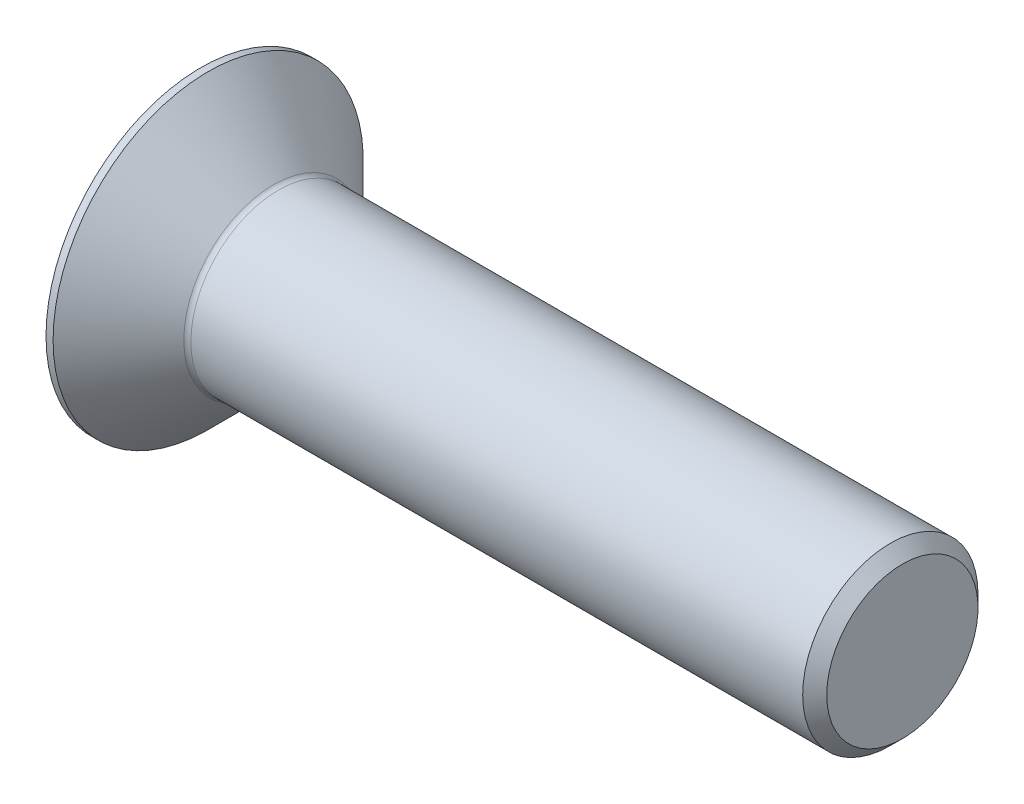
ISO-10303-21;
HEADER;
FILE_DESCRIPTION(('STEP AP214'),'2;1');
FILE_NAME('part.step','',(''),(''),'','','');
FILE_SCHEMA(('AUTOMOTIVE_DESIGN { 1 0 10303 214 1 1 1 1 }'));
ENDSEC;
DATA;
#1=APPLICATION_CONTEXT('core data for automotive mechanical design processes');
#2=APPLICATION_PROTOCOL_DEFINITION('international standard','automotive_design',2000,#1);
#3=PRODUCT_CONTEXT('',#1,'mechanical');
#4=PRODUCT('Part','Part','',(#3));
#5=PRODUCT_RELATED_PRODUCT_CATEGORY('part','',(#4));
#6=PRODUCT_DEFINITION_FORMATION('','',#4);
#7=PRODUCT_DEFINITION_CONTEXT('part definition',#1,'design');
#8=PRODUCT_DEFINITION('design','',#6,#7);
#9=PRODUCT_DEFINITION_SHAPE('','',#8);
#10=(LENGTH_UNIT() NAMED_UNIT(*) SI_UNIT(.MILLI.,.METRE.));
#11=(NAMED_UNIT(*) PLANE_ANGLE_UNIT() SI_UNIT($,.RADIAN.));
#12=(NAMED_UNIT(*) SI_UNIT($,.STERADIAN.) SOLID_ANGLE_UNIT());
#13=UNCERTAINTY_MEASURE_WITH_UNIT(LENGTH_MEASURE(1.E-05),#10,'distance_accuracy_value','');
#14=(GEOMETRIC_REPRESENTATION_CONTEXT(3) GLOBAL_UNCERTAINTY_ASSIGNED_CONTEXT((#13)) GLOBAL_UNIT_ASSIGNED_CONTEXT((#10,
#11,#12)) REPRESENTATION_CONTEXT('',''));
#15=CARTESIAN_POINT('',(0.,0.,0.));
#16=DIRECTION('',(0.,0.,1.));
#17=DIRECTION('',(1.,0.,0.));
#18=AXIS2_PLACEMENT_3D('',#15,#16,#17);
#19=CARTESIAN_POINT('',(0.,0.,0.));
#20=DIRECTION('',(-1.,0.,0.));
#21=DIRECTION('',(0.,0.,1.));
#22=AXIS2_PLACEMENT_3D('',#19,#20,#21);
#23=PLANE('',#22);
#24=CARTESIAN_POINT('',(0.,0.,0.));
#25=DIRECTION('',(-1.,0.,0.));
#26=DIRECTION('',(0.,0.,1.));
#27=AXIS2_PLACEMENT_3D('',#24,#25,#26);
#28=CIRCLE('',#27,17.69);
#29=CARTESIAN_POINT('',(0.,0.,17.69));
#30=VERTEX_POINT('',#29);
#31=EDGE_CURVE('E153',#30,#30,#28,.T.);
#32=ORIENTED_EDGE('',*,*,#31,.T.);
#33=EDGE_LOOP('',(#32));
#34=FACE_BOUND('',#33,.T.);
#35=DIRECTION('',(0.,-0.499999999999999,-0.866025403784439));
#36=VECTOR('',#35,1.);
#37=CARTESIAN_POINT('',(0.,-3.46410161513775,6.));
#38=LINE('',#37,#36);
#39=CARTESIAN_POINT('',(0.,-3.46410161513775,6.));
#40=VERTEX_POINT('',#39);
#41=CARTESIAN_POINT('',(0.,-6.92820323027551,0.));
#42=VERTEX_POINT('',#41);
#43=EDGE_CURVE('E119',#40,#42,#38,.T.);
#44=ORIENTED_EDGE('',*,*,#43,.T.);
#45=DIRECTION('',(0.,0.5,-0.866025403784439));
#46=VECTOR('',#45,1.);
#47=CARTESIAN_POINT('',(0.,-6.9282032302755,0.));
#48=LINE('',#47,#46);
#49=CARTESIAN_POINT('',(0.,-3.46410161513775,-6.));
#50=VERTEX_POINT('',#49);
#51=EDGE_CURVE('E50',#42,#50,#48,.T.);
#52=ORIENTED_EDGE('',*,*,#51,.T.);
#53=DIRECTION('',(0.,1.,0.));
#54=VECTOR('',#53,1.);
#55=CARTESIAN_POINT('',(0.,-3.46410161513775,-6.));
#56=LINE('',#55,#54);
#57=CARTESIAN_POINT('',(0.,3.46410161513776,-6.));
#58=VERTEX_POINT('',#57);
#59=EDGE_CURVE('E130',#50,#58,#56,.T.);
#60=ORIENTED_EDGE('',*,*,#59,.T.);
#61=DIRECTION('',(0.,0.5,0.866025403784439));
#62=VECTOR('',#61,1.);
#63=CARTESIAN_POINT('',(0.,3.46410161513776,-6.));
#64=LINE('',#63,#62);
#65=CARTESIAN_POINT('',(0.,6.92820323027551,0.));
#66=VERTEX_POINT('',#65);
#67=EDGE_CURVE('E254',#58,#66,#64,.T.);
#68=ORIENTED_EDGE('',*,*,#67,.T.);
#69=DIRECTION('',(0.,-0.5,0.866025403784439));
#70=VECTOR('',#69,1.);
#71=CARTESIAN_POINT('',(0.,6.92820323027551,0.));
#72=LINE('',#71,#70);
#73=CARTESIAN_POINT('',(0.,3.46410161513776,6.));
#74=VERTEX_POINT('',#73);
#75=EDGE_CURVE('E257',#66,#74,#72,.T.);
#76=ORIENTED_EDGE('',*,*,#75,.T.);
#77=DIRECTION('',(0.,-1.,0.));
#78=VECTOR('',#77,1.);
#79=CARTESIAN_POINT('',(0.,3.46410161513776,6.));
#80=LINE('',#79,#78);
#81=EDGE_CURVE('E260',#74,#40,#80,.T.);
#82=ORIENTED_EDGE('',*,*,#81,.T.);
#83=EDGE_LOOP('',(#44,#52,#60,#68,#76,#82));
#84=FACE_BOUND('',#83,.T.);
#85=ADVANCED_FACE('F35',(#34,#84),#23,.T.);
#86=CARTESIAN_POINT('',(0.,0.,0.));
#87=DIRECTION('',(-1.,0.,0.));
#88=DIRECTION('',(0.,0.,1.));
#89=AXIS2_PLACEMENT_3D('',#86,#87,#88);
#90=CYLINDRICAL_SURFACE('',#89,17.69);
#91=CARTESIAN_POINT('',(0.810000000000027,0.,0.));
#92=DIRECTION('',(-1.,0.,0.));
#93=DIRECTION('',(0.,0.,1.));
#94=AXIS2_PLACEMENT_3D('',#91,#92,#93);
#95=CIRCLE('',#94,17.69);
#96=CARTESIAN_POINT('',(0.810000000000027,0.,17.69));
#97=VERTEX_POINT('',#96);
#98=EDGE_CURVE('E150',#97,#97,#95,.T.);
#99=ORIENTED_EDGE('',*,*,#98,.T.);
#100=EDGE_LOOP('',(#99));
#101=FACE_BOUND('',#100,.T.);
#102=ORIENTED_EDGE('',*,*,#31,.F.);
#103=EDGE_LOOP('',(#102));
#104=FACE_BOUND('',#103,.T.);
#105=ADVANCED_FACE('F174',(#101,#104),#90,.T.);
#106=CARTESIAN_POINT('',(0.810000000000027,0.,0.));
#107=DIRECTION('',(-1.,0.,0.));
#108=DIRECTION('',(0.,0.,1.));
#109=AXIS2_PLACEMENT_3D('',#106,#107,#108);
#110=CONICAL_SURFACE('',#109,17.69,0.78539816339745);
#111=CARTESIAN_POINT('',(8.26568542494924,0.,0.));
#112=DIRECTION('',(-1.,0.,0.));
#113=DIRECTION('',(0.,0.,1.));
#114=AXIS2_PLACEMENT_3D('',#111,#112,#113);
#115=CIRCLE('',#114,10.2343145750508);
#116=CARTESIAN_POINT('',(8.26568542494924,0.,10.2343145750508));
#117=VERTEX_POINT('',#116);
#118=EDGE_CURVE('E43',#117,#117,#115,.T.);
#119=ORIENTED_EDGE('',*,*,#118,.T.);
#120=EDGE_LOOP('',(#119));
#121=FACE_BOUND('',#120,.T.);
#122=ORIENTED_EDGE('',*,*,#98,.F.);
#123=EDGE_LOOP('',(#122));
#124=FACE_BOUND('',#123,.T.);
#125=ADVANCED_FACE('F158',(#121,#124),#110,.T.);
#126=CARTESIAN_POINT('',(0.,0.,0.));
#127=DIRECTION('',(-1.,0.,0.));
#128=DIRECTION('',(0.,0.,1.));
#129=AXIS2_PLACEMENT_3D('',#126,#127,#128);
#130=CYLINDRICAL_SURFACE('',#129,10.);
#131=CARTESIAN_POINT('',(8.83137084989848,0.,0.));
#132=DIRECTION('',(-1.,0.,0.));
#133=DIRECTION('',(0.,0.,1.));
#134=AXIS2_PLACEMENT_3D('',#131,#132,#133);
#135=CIRCLE('',#134,10.);
#136=CARTESIAN_POINT('',(8.83137084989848,0.,10.));
#137=VERTEX_POINT('',#136);
#138=EDGE_CURVE('E11',#137,#137,#135,.F.);
#139=ORIENTED_EDGE('',*,*,#138,.T.);
#140=EDGE_LOOP('',(#139));
#141=FACE_BOUND('',#140,.T.);
#142=CARTESIAN_POINT('',(78.6259999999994,0.,0.));
#143=DIRECTION('',(-1.,0.,0.));
#144=DIRECTION('',(0.,0.,1.));
#145=AXIS2_PLACEMENT_3D('',#142,#143,#144);
#146=CIRCLE('',#145,10.);
#147=CARTESIAN_POINT('',(78.6259999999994,0.,10.));
#148=VERTEX_POINT('',#147);
#149=EDGE_CURVE('E147',#148,#148,#146,.T.);
#150=ORIENTED_EDGE('',*,*,#149,.T.);
#151=EDGE_LOOP('',(#150));
#152=FACE_BOUND('',#151,.T.);
#153=ADVANCED_FACE('F185',(#141,#152),#130,.T.);
#154=CARTESIAN_POINT('',(80.,0.,0.));
#155=DIRECTION('',(-1.,0.,0.));
#156=DIRECTION('',(0.,0.,1.));
#157=AXIS2_PLACEMENT_3D('',#154,#155,#156);
#158=CONICAL_SURFACE('',#157,8.626,0.785398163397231);
#159=ORIENTED_EDGE('',*,*,#149,.F.);
#160=EDGE_LOOP('',(#159));
#161=FACE_BOUND('',#160,.T.);
#162=CARTESIAN_POINT('',(80.,0.,0.));
#163=DIRECTION('',(-1.,0.,0.));
#164=DIRECTION('',(0.,0.,1.));
#165=AXIS2_PLACEMENT_3D('',#162,#163,#164);
#166=CIRCLE('',#165,8.626);
#167=CARTESIAN_POINT('',(80.,0.,8.626));
#168=VERTEX_POINT('',#167);
#169=EDGE_CURVE('E143',#168,#168,#166,.T.);
#170=ORIENTED_EDGE('',*,*,#169,.T.);
#171=EDGE_LOOP('',(#170));
#172=FACE_BOUND('',#171,.T.);
#173=ADVANCED_FACE('F169',(#161,#172),#158,.T.);
#174=CARTESIAN_POINT('',(80.,8.626,0.));
#175=DIRECTION('',(1.,0.,0.));
#176=DIRECTION('',(0.,0.,-1.));
#177=AXIS2_PLACEMENT_3D('',#174,#175,#176);
#178=PLANE('',#177);
#179=ORIENTED_EDGE('',*,*,#169,.F.);
#180=EDGE_LOOP('',(#179));
#181=FACE_BOUND('',#180,.T.);
#182=ADVANCED_FACE('F162',(#181),#178,.T.);
#183=CARTESIAN_POINT('',(8.83137084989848,0.,0.));
#184=DIRECTION('',(-1.,0.,0.));
#185=DIRECTION('',(0.,0.,1.));
#186=AXIS2_PLACEMENT_3D('',#183,#184,#185);
#187=TOROIDAL_SURFACE('',#186,10.8,0.8);
#188=ORIENTED_EDGE('',*,*,#138,.F.);
#189=EDGE_LOOP('',(#188));
#190=FACE_BOUND('',#189,.T.);
#191=ORIENTED_EDGE('',*,*,#118,.F.);
#192=EDGE_LOOP('',(#191));
#193=FACE_BOUND('',#192,.T.);
#194=ADVANCED_FACE('F37',(#190,#193),#187,.F.);
#195=CARTESIAN_POINT('',(5.6,-6.9282032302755,0.));
#196=DIRECTION('',(0.,0.866025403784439,0.5));
#197=DIRECTION('',(0.,-0.5,0.866025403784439));
#198=AXIS2_PLACEMENT_3D('',#195,#196,#197);
#199=PLANE('',#198);
#200=ORIENTED_EDGE('',*,*,#51,.F.);
#201=DIRECTION('',(-1.,0.,0.));
#202=VECTOR('',#201,1.);
#203=CARTESIAN_POINT('',(5.6,-6.9282032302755,0.));
#204=LINE('',#203,#202);
#205=CARTESIAN_POINT('',(5.6,-6.9282032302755,0.));
#206=VERTEX_POINT('',#205);
#207=EDGE_CURVE('E251',#206,#42,#204,.T.);
#208=ORIENTED_EDGE('',*,*,#207,.F.);
#209=DIRECTION('',(0.,0.5,-0.866025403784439));
#210=VECTOR('',#209,1.);
#211=CARTESIAN_POINT('',(5.6,-6.9282032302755,0.));
#212=LINE('',#211,#210);
#213=CARTESIAN_POINT('',(5.6,-5.19615242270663,-3.));
#214=VERTEX_POINT('',#213);
#215=EDGE_CURVE('E115',#206,#214,#212,.T.);
#216=ORIENTED_EDGE('',*,*,#215,.T.);
#217=CARTESIAN_POINT('',(5.6,-3.46410161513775,-6.));
#218=VERTEX_POINT('',#217);
#219=EDGE_CURVE('E111',#214,#218,#212,.T.);
#220=ORIENTED_EDGE('',*,*,#219,.T.);
#221=DIRECTION('',(-1.,0.,0.));
#222=VECTOR('',#221,1.);
#223=CARTESIAN_POINT('',(5.6,-3.46410161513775,-6.));
#224=LINE('',#223,#222);
#225=EDGE_CURVE('E113',#218,#50,#224,.T.);
#226=ORIENTED_EDGE('',*,*,#225,.T.);
#227=EDGE_LOOP('',(#200,#208,#216,#220,#226));
#228=FACE_BOUND('',#227,.T.);
#229=ADVANCED_FACE('F112',(#228),#199,.T.);
#230=CARTESIAN_POINT('',(5.6,-3.46410161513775,-6.));
#231=DIRECTION('',(0.,0.,1.));
#232=DIRECTION('',(0.,-1.,0.));
#233=AXIS2_PLACEMENT_3D('',#230,#231,#232);
#234=PLANE('',#233);
#235=ORIENTED_EDGE('',*,*,#59,.F.);
#236=ORIENTED_EDGE('',*,*,#225,.F.);
#237=DIRECTION('',(0.,1.,0.));
#238=VECTOR('',#237,1.);
#239=CARTESIAN_POINT('',(5.6,-3.46410161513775,-6.));
#240=LINE('',#239,#238);
#241=CARTESIAN_POINT('',(5.6,0.,-6.));
#242=VERTEX_POINT('',#241);
#243=EDGE_CURVE('E58',#218,#242,#240,.T.);
#244=ORIENTED_EDGE('',*,*,#243,.T.);
#245=CARTESIAN_POINT('',(5.6,3.46410161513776,-6.));
#246=VERTEX_POINT('',#245);
#247=EDGE_CURVE('E125',#242,#246,#240,.T.);
#248=ORIENTED_EDGE('',*,*,#247,.T.);
#249=DIRECTION('',(-1.,0.,0.));
#250=VECTOR('',#249,1.);
#251=CARTESIAN_POINT('',(5.6,3.46410161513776,-6.));
#252=LINE('',#251,#250);
#253=EDGE_CURVE('E132',#246,#58,#252,.T.);
#254=ORIENTED_EDGE('',*,*,#253,.T.);
#255=EDGE_LOOP('',(#235,#236,#244,#248,#254));
#256=FACE_BOUND('',#255,.T.);
#257=ADVANCED_FACE('F127',(#256),#234,.T.);
#258=CARTESIAN_POINT('',(5.6,3.46410161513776,-6.));
#259=DIRECTION('',(0.,-0.866025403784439,0.5));
#260=DIRECTION('',(0.,-0.5,-0.866025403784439));
#261=AXIS2_PLACEMENT_3D('',#258,#259,#260);
#262=PLANE('',#261);
#263=ORIENTED_EDGE('',*,*,#67,.F.);
#264=ORIENTED_EDGE('',*,*,#253,.F.);
#265=DIRECTION('',(0.,0.5,0.866025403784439));
#266=VECTOR('',#265,1.);
#267=CARTESIAN_POINT('',(5.6,3.46410161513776,-6.));
#268=LINE('',#267,#266);
#269=CARTESIAN_POINT('',(5.6,5.19615242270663,-3.));
#270=VERTEX_POINT('',#269);
#271=EDGE_CURVE('E232',#246,#270,#268,.T.);
#272=ORIENTED_EDGE('',*,*,#271,.T.);
#273=CARTESIAN_POINT('',(5.6,6.92820323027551,0.));
#274=VERTEX_POINT('',#273);
#275=EDGE_CURVE('E124',#270,#274,#268,.T.);
#276=ORIENTED_EDGE('',*,*,#275,.T.);
#277=DIRECTION('',(-1.,0.,0.));
#278=VECTOR('',#277,1.);
#279=CARTESIAN_POINT('',(5.6,6.92820323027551,0.));
#280=LINE('',#279,#278);
#281=EDGE_CURVE('E138',#274,#66,#280,.T.);
#282=ORIENTED_EDGE('',*,*,#281,.T.);
#283=EDGE_LOOP('',(#263,#264,#272,#276,#282));
#284=FACE_BOUND('',#283,.T.);
#285=ADVANCED_FACE('F199',(#284),#262,.T.);
#286=CARTESIAN_POINT('',(5.6,6.92820323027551,0.));
#287=DIRECTION('',(0.,-0.866025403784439,-0.5));
#288=DIRECTION('',(0.,0.5,-0.866025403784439));
#289=AXIS2_PLACEMENT_3D('',#286,#287,#288);
#290=PLANE('',#289);
#291=ORIENTED_EDGE('',*,*,#75,.F.);
#292=ORIENTED_EDGE('',*,*,#281,.F.);
#293=DIRECTION('',(0.,-0.5,0.866025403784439));
#294=VECTOR('',#293,1.);
#295=CARTESIAN_POINT('',(5.6,6.92820323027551,0.));
#296=LINE('',#295,#294);
#297=CARTESIAN_POINT('',(5.6,5.19615242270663,3.));
#298=VERTEX_POINT('',#297);
#299=EDGE_CURVE('E239',#274,#298,#296,.T.);
#300=ORIENTED_EDGE('',*,*,#299,.T.);
#301=CARTESIAN_POINT('',(5.6,3.46410161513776,6.));
#302=VERTEX_POINT('',#301);
#303=EDGE_CURVE('E237',#298,#302,#296,.T.);
#304=ORIENTED_EDGE('',*,*,#303,.T.);
#305=DIRECTION('',(-1.,0.,0.));
#306=VECTOR('',#305,1.);
#307=CARTESIAN_POINT('',(5.6,3.46410161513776,6.));
#308=LINE('',#307,#306);
#309=EDGE_CURVE('E269',#302,#74,#308,.T.);
#310=ORIENTED_EDGE('',*,*,#309,.T.);
#311=EDGE_LOOP('',(#291,#292,#300,#304,#310));
#312=FACE_BOUND('',#311,.T.);
#313=ADVANCED_FACE('F202',(#312),#290,.T.);
#314=CARTESIAN_POINT('',(5.6,3.46410161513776,6.));
#315=DIRECTION('',(0.,0.,-1.));
#316=DIRECTION('',(-1.,0.,0.));
#317=AXIS2_PLACEMENT_3D('',#314,#315,#316);
#318=PLANE('',#317);
#319=ORIENTED_EDGE('',*,*,#81,.F.);
#320=ORIENTED_EDGE('',*,*,#309,.F.);
#321=DIRECTION('',(0.,-1.,0.));
#322=VECTOR('',#321,1.);
#323=CARTESIAN_POINT('',(5.6,3.46410161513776,6.));
#324=LINE('',#323,#322);
#325=CARTESIAN_POINT('',(5.6,0.,6.));
#326=VERTEX_POINT('',#325);
#327=EDGE_CURVE('E244',#302,#326,#324,.T.);
#328=ORIENTED_EDGE('',*,*,#327,.T.);
#329=CARTESIAN_POINT('',(5.6,-3.46410161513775,6.));
#330=VERTEX_POINT('',#329);
#331=EDGE_CURVE('E243',#326,#330,#324,.T.);
#332=ORIENTED_EDGE('',*,*,#331,.T.);
#333=DIRECTION('',(-1.,0.,0.));
#334=VECTOR('',#333,1.);
#335=CARTESIAN_POINT('',(5.6,-3.46410161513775,6.));
#336=LINE('',#335,#334);
#337=EDGE_CURVE('E266',#330,#40,#336,.T.);
#338=ORIENTED_EDGE('',*,*,#337,.T.);
#339=EDGE_LOOP('',(#319,#320,#328,#332,#338));
#340=FACE_BOUND('',#339,.T.);
#341=ADVANCED_FACE('F206',(#340),#318,.T.);
#342=CARTESIAN_POINT('',(5.6,-3.46410161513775,6.));
#343=DIRECTION('',(0.,0.866025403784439,-0.5));
#344=DIRECTION('',(0.,0.5,0.866025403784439));
#345=AXIS2_PLACEMENT_3D('',#342,#343,#344);
#346=PLANE('',#345);
#347=ORIENTED_EDGE('',*,*,#43,.F.);
#348=ORIENTED_EDGE('',*,*,#337,.F.);
#349=DIRECTION('',(0.,-0.499999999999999,-0.866025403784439));
#350=VECTOR('',#349,1.);
#351=CARTESIAN_POINT('',(5.6,-3.46410161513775,6.));
#352=LINE('',#351,#350);
#353=CARTESIAN_POINT('',(5.6,-5.19615242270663,3.));
#354=VERTEX_POINT('',#353);
#355=EDGE_CURVE('E248',#330,#354,#352,.T.);
#356=ORIENTED_EDGE('',*,*,#355,.T.);
#357=EDGE_CURVE('E247',#354,#206,#352,.T.);
#358=ORIENTED_EDGE('',*,*,#357,.T.);
#359=ORIENTED_EDGE('',*,*,#207,.T.);
#360=EDGE_LOOP('',(#347,#348,#356,#358,#359));
#361=FACE_BOUND('',#360,.T.);
#362=ADVANCED_FACE('F210',(#361),#346,.T.);
#363=CARTESIAN_POINT('',(5.6,-3.46410161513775,-6.));
#364=DIRECTION('',(1.,0.,0.));
#365=DIRECTION('',(0.,0.,-1.));
#366=AXIS2_PLACEMENT_3D('',#363,#364,#365);
#367=PLANE('',#366);
#368=ORIENTED_EDGE('',*,*,#243,.F.);
#369=ORIENTED_EDGE('',*,*,#219,.F.);
#370=CARTESIAN_POINT('',(5.6,0.,0.));
#371=DIRECTION('',(-1.,0.,0.));
#372=DIRECTION('',(0.,0.,1.));
#373=AXIS2_PLACEMENT_3D('',#370,#371,#372);
#374=CIRCLE('',#373,6.);
#375=EDGE_CURVE('E122',#242,#214,#374,.T.);
#376=ORIENTED_EDGE('',*,*,#375,.F.);
#377=EDGE_LOOP('',(#368,#369,#376));
#378=FACE_BOUND('',#377,.T.);
#379=ADVANCED_FACE('F121',(#378),#367,.F.);
#380=ORIENTED_EDGE('',*,*,#215,.F.);
#381=ORIENTED_EDGE('',*,*,#357,.F.);
#382=EDGE_CURVE('E135',#214,#354,#374,.T.);
#383=ORIENTED_EDGE('',*,*,#382,.F.);
#384=EDGE_LOOP('',(#380,#381,#383));
#385=FACE_BOUND('',#384,.T.);
#386=ADVANCED_FACE('F216',(#385),#367,.F.);
#387=ORIENTED_EDGE('',*,*,#355,.F.);
#388=ORIENTED_EDGE('',*,*,#331,.F.);
#389=EDGE_CURVE('E131',#354,#326,#374,.T.);
#390=ORIENTED_EDGE('',*,*,#389,.F.);
#391=EDGE_LOOP('',(#387,#388,#390));
#392=FACE_BOUND('',#391,.T.);
#393=ADVANCED_FACE('F220',(#392),#367,.F.);
#394=ORIENTED_EDGE('',*,*,#327,.F.);
#395=ORIENTED_EDGE('',*,*,#303,.F.);
#396=EDGE_CURVE('E137',#326,#298,#374,.T.);
#397=ORIENTED_EDGE('',*,*,#396,.F.);
#398=EDGE_LOOP('',(#394,#395,#397));
#399=FACE_BOUND('',#398,.T.);
#400=ADVANCED_FACE('F228',(#399),#367,.F.);
#401=ORIENTED_EDGE('',*,*,#299,.F.);
#402=ORIENTED_EDGE('',*,*,#275,.F.);
#403=EDGE_CURVE('E144',#298,#270,#374,.T.);
#404=ORIENTED_EDGE('',*,*,#403,.F.);
#405=EDGE_LOOP('',(#401,#402,#404));
#406=FACE_BOUND('',#405,.T.);
#407=ADVANCED_FACE('F223',(#406),#367,.F.);
#408=ORIENTED_EDGE('',*,*,#271,.F.);
#409=ORIENTED_EDGE('',*,*,#247,.F.);
#410=EDGE_CURVE('E233',#270,#242,#374,.T.);
#411=ORIENTED_EDGE('',*,*,#410,.F.);
#412=EDGE_LOOP('',(#408,#409,#411));
#413=FACE_BOUND('',#412,.T.);
#414=ADVANCED_FACE('F194',(#413),#367,.F.);
#415=CARTESIAN_POINT('',(5.6,0.,0.));
#416=DIRECTION('',(-1.,0.,0.));
#417=DIRECTION('',(0.,0.,1.));
#418=AXIS2_PLACEMENT_3D('',#415,#416,#417);
#419=CONICAL_SURFACE('',#418,6.,1.04719755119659);
#420=CARTESIAN_POINT('',(9.06410161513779,0.,0.));
#421=VERTEX_POINT('',#420);
#422=VERTEX_LOOP('',#421);
#423=FACE_BOUND('',#422,.T.);
#424=ORIENTED_EDGE('',*,*,#396,.T.);
#425=ORIENTED_EDGE('',*,*,#403,.T.);
#426=ORIENTED_EDGE('',*,*,#410,.T.);
#427=ORIENTED_EDGE('',*,*,#375,.T.);
#428=ORIENTED_EDGE('',*,*,#382,.T.);
#429=ORIENTED_EDGE('',*,*,#389,.T.);
#430=EDGE_LOOP('',(#424,#425,#426,#427,#428,#429));
#431=FACE_BOUND('',#430,.T.);
#432=ADVANCED_FACE('F192',(#423,#431),#419,.F.);
#433=CLOSED_SHELL('',(#85,#105,#125,#153,#173,#182,#194,#229,#257,#285,#313,#341,#362,#379,#386,
#393,#400,#407,#414,#432));
#434=MANIFOLD_SOLID_BREP('B2',#433);
#435=ADVANCED_BREP_SHAPE_REPRESENTATION('',(#18,#434),#14);
#436=SHAPE_DEFINITION_REPRESENTATION(#9,#435);
ENDSEC;
END-ISO-10303-21;
